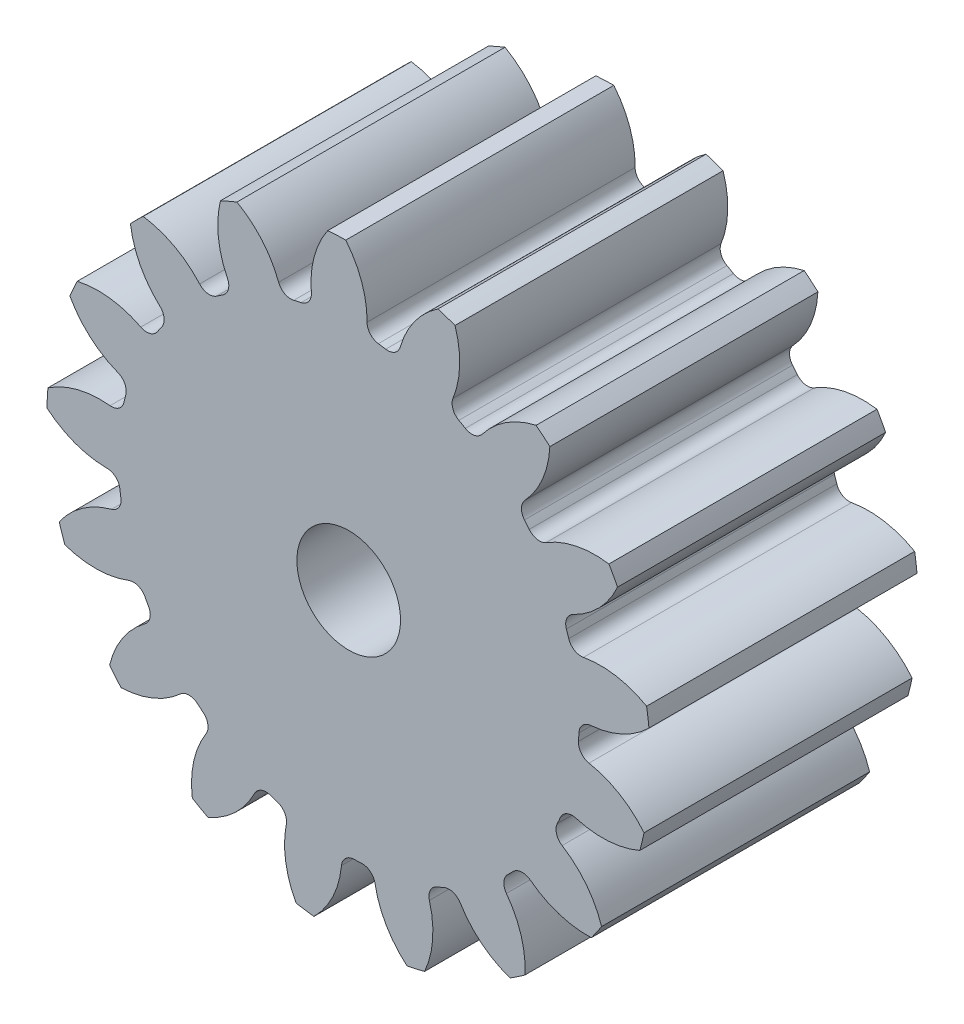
from build123d import *

# Parameters (mm, degrees)
SKETCH3_R         = 107.244444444
GEARBODY_DEPTH    = 95.25
TOOTHCUT_DEPTH    = 180.095796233
CIRPATTERN1_COUNT = 17
BOREDIA_R         = 18.415
BORE_DEPTH        = 12700


with BuildPart() as part:
    # Sketch3 → gearBody (new body)
    with BuildSketch(Plane.XY):
        Circle(SKETCH3_R)
    extrude(amount=GEARBODY_DEPTH)

    # Sketch2 → toothCut (cut, through all)
    with BuildSketch(Plane.XY):
        with BuildLine():
            ThreePointArc((81.648970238, -5.653206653), (81.730156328, -4.32372906), (81.789696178, -2.993106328))
            ThreePointArc((81.789696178, -2.993106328), (83.060220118, 0.013962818), (86.007221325, 1.418199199))
            ThreePointArc((86.007221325, 1.418199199), (97.548749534, 4.518975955), (107.244444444, 11.505762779))
            ThreePointArc((107.244444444, 11.505762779), (107.709262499, -5.698088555), (105.431865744, -22.756869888))
            ThreePointArc((105.431865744, -22.756869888), (96.527463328, -14.786091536), (85.377518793, -10.484879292))
            ThreePointArc((85.377518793, -10.484879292), (82.595127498, -8.777543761), (81.648970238, -5.653206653))
        make_face()
    toothcut = extrude(amount=TOOTHCUT_DEPTH, mode=Mode.SUBTRACT)

    # CirPattern1: toothCut ×17 about axis
    cirpattern1_axis = Axis((0, 0, 0), (0, 0, 1))
    for i in range(1, CIRPATTERN1_COUNT):
        add(toothcut.rotate(cirpattern1_axis, i * 360 / CIRPATTERN1_COUNT), mode=Mode.SUBTRACT)

    # boreDia → bore (cut, symmetric)
    with BuildSketch(Plane.XY):
        Circle(BOREDIA_R)
    extrude(amount=BORE_DEPTH, both=True, mode=Mode.SUBTRACT)


solid = part.part
